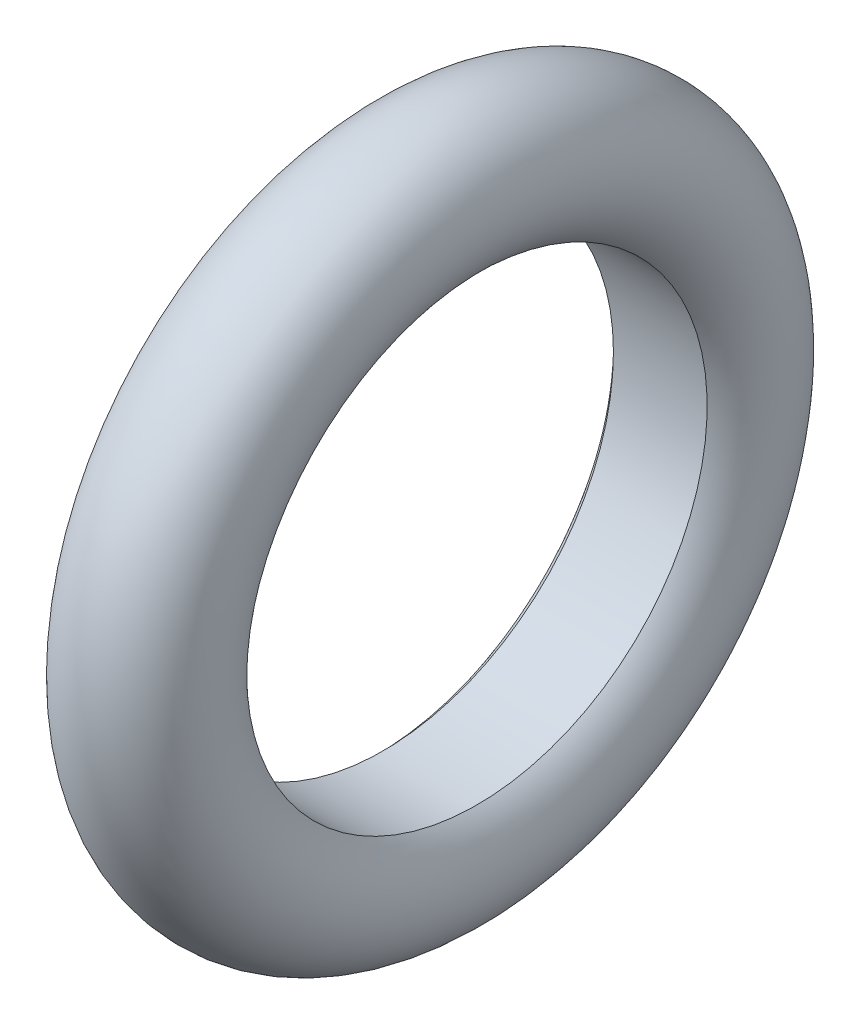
ISO-10303-21;
HEADER;
FILE_DESCRIPTION(('STEP AP214'),'2;1');
FILE_NAME('part.step','',(''),(''),'','','');
FILE_SCHEMA(('AUTOMOTIVE_DESIGN { 1 0 10303 214 1 1 1 1 }'));
ENDSEC;
DATA;
#1=APPLICATION_CONTEXT('core data for automotive mechanical design processes');
#2=APPLICATION_PROTOCOL_DEFINITION('international standard','automotive_design',2000,#1);
#3=PRODUCT_CONTEXT('',#1,'mechanical');
#4=PRODUCT('Part','Part','',(#3));
#5=PRODUCT_RELATED_PRODUCT_CATEGORY('part','',(#4));
#6=PRODUCT_DEFINITION_FORMATION('','',#4);
#7=PRODUCT_DEFINITION_CONTEXT('part definition',#1,'design');
#8=PRODUCT_DEFINITION('design','',#6,#7);
#9=PRODUCT_DEFINITION_SHAPE('','',#8);
#10=(LENGTH_UNIT() NAMED_UNIT(*) SI_UNIT(.MILLI.,.METRE.));
#11=(NAMED_UNIT(*) PLANE_ANGLE_UNIT() SI_UNIT($,.RADIAN.));
#12=(NAMED_UNIT(*) SI_UNIT($,.STERADIAN.) SOLID_ANGLE_UNIT());
#13=UNCERTAINTY_MEASURE_WITH_UNIT(LENGTH_MEASURE(1.E-05),#10,'distance_accuracy_value','');
#14=(GEOMETRIC_REPRESENTATION_CONTEXT(3) GLOBAL_UNCERTAINTY_ASSIGNED_CONTEXT((#13)) GLOBAL_UNIT_ASSIGNED_CONTEXT((#10,
#11,#12)) REPRESENTATION_CONTEXT('',''));
#15=CARTESIAN_POINT('',(0.,0.,0.));
#16=DIRECTION('',(0.,0.,1.));
#17=DIRECTION('',(1.,0.,0.));
#18=AXIS2_PLACEMENT_3D('',#15,#16,#17);
#19=CARTESIAN_POINT('',(0.,0.,0.));
#20=DIRECTION('',(-1.,0.,0.));
#21=DIRECTION('',(0.,0.,1.));
#22=AXIS2_PLACEMENT_3D('',#19,#20,#21);
#23=TOROIDAL_SURFACE('',#22,4.,1.);
#24=CARTESIAN_POINT('',(-0.661437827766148,0.,0.));
#25=DIRECTION('',(1.,0.,0.));
#26=DIRECTION('',(0.,0.,-1.));
#27=AXIS2_PLACEMENT_3D('',#24,#25,#26);
#28=CIRCLE('',#27,3.25);
#29=CARTESIAN_POINT('',(-0.661437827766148,0.,-3.25));
#30=VERTEX_POINT('',#29);
#31=EDGE_CURVE('E10',#30,#30,#28,.T.);
#32=ORIENTED_EDGE('',*,*,#31,.T.);
#33=EDGE_LOOP('',(#32));
#34=FACE_BOUND('',#33,.T.);
#35=CARTESIAN_POINT('',(0.661437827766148,0.,0.));
#36=DIRECTION('',(-1.,0.,0.));
#37=DIRECTION('',(0.,0.,1.));
#38=AXIS2_PLACEMENT_3D('',#35,#36,#37);
#39=CIRCLE('',#38,3.25);
#40=CARTESIAN_POINT('',(0.661437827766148,0.,3.25));
#41=VERTEX_POINT('',#40);
#42=EDGE_CURVE('E34',#41,#41,#39,.T.);
#43=ORIENTED_EDGE('',*,*,#42,.T.);
#44=EDGE_LOOP('',(#43));
#45=FACE_BOUND('',#44,.T.);
#46=ADVANCED_FACE('F28',(#34,#45),#23,.T.);
#47=CARTESIAN_POINT('',(-1.,0.,0.));
#48=DIRECTION('',(1.,0.,0.));
#49=DIRECTION('',(0.,0.,-1.));
#50=AXIS2_PLACEMENT_3D('',#47,#48,#49);
#51=CYLINDRICAL_SURFACE('',#50,3.25);
#52=ORIENTED_EDGE('',*,*,#42,.F.);
#53=EDGE_LOOP('',(#52));
#54=FACE_BOUND('',#53,.T.);
#55=ORIENTED_EDGE('',*,*,#31,.F.);
#56=EDGE_LOOP('',(#55));
#57=FACE_BOUND('',#56,.T.);
#58=ADVANCED_FACE('F41',(#54,#57),#51,.F.);
#59=CLOSED_SHELL('',(#46,#58));
#60=MANIFOLD_SOLID_BREP('B2',#59);
#61=ADVANCED_BREP_SHAPE_REPRESENTATION('',(#18,#60),#14);
#62=SHAPE_DEFINITION_REPRESENTATION(#9,#61);
ENDSEC;
END-ISO-10303-21;
